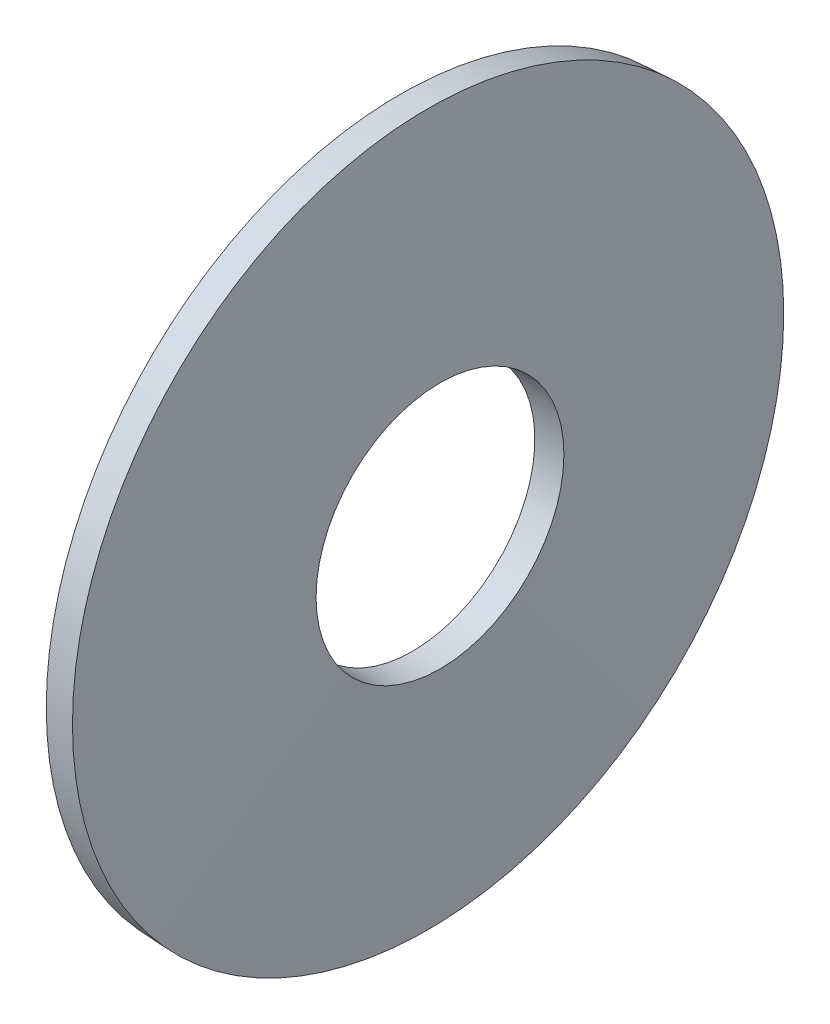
ISO-10303-21;
HEADER;
FILE_DESCRIPTION(('STEP AP214'),'2;1');
FILE_NAME('part.step','',(''),(''),'','','');
FILE_SCHEMA(('AUTOMOTIVE_DESIGN { 1 0 10303 214 1 1 1 1 }'));
ENDSEC;
DATA;
#1=APPLICATION_CONTEXT('core data for automotive mechanical design processes');
#2=APPLICATION_PROTOCOL_DEFINITION('international standard','automotive_design',2000,#1);
#3=PRODUCT_CONTEXT('',#1,'mechanical');
#4=PRODUCT('Part','Part','',(#3));
#5=PRODUCT_RELATED_PRODUCT_CATEGORY('part','',(#4));
#6=PRODUCT_DEFINITION_FORMATION('','',#4);
#7=PRODUCT_DEFINITION_CONTEXT('part definition',#1,'design');
#8=PRODUCT_DEFINITION('design','',#6,#7);
#9=PRODUCT_DEFINITION_SHAPE('','',#8);
#10=(LENGTH_UNIT() NAMED_UNIT(*) SI_UNIT(.MILLI.,.METRE.));
#11=(NAMED_UNIT(*) PLANE_ANGLE_UNIT() SI_UNIT($,.RADIAN.));
#12=(NAMED_UNIT(*) SI_UNIT($,.STERADIAN.) SOLID_ANGLE_UNIT());
#13=UNCERTAINTY_MEASURE_WITH_UNIT(LENGTH_MEASURE(1.E-05),#10,'distance_accuracy_value','');
#14=(GEOMETRIC_REPRESENTATION_CONTEXT(3) GLOBAL_UNCERTAINTY_ASSIGNED_CONTEXT((#13)) GLOBAL_UNIT_ASSIGNED_CONTEXT((#10,
#11,#12)) REPRESENTATION_CONTEXT('',''));
#15=CARTESIAN_POINT('',(0.,0.,0.));
#16=DIRECTION('',(0.,0.,1.));
#17=DIRECTION('',(1.,0.,0.));
#18=AXIS2_PLACEMENT_3D('',#15,#16,#17);
#19=CARTESIAN_POINT('',(0.69908017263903,0.,0.));
#20=DIRECTION('',(1.,0.,0.));
#21=DIRECTION('',(0.,0.,-1.));
#22=AXIS2_PLACEMENT_3D('',#19,#20,#21);
#23=CONICAL_SURFACE('',#22,9.,0.0512704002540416);
#24=CARTESIAN_POINT('',(0.,0.,0.));
#25=DIRECTION('',(-1.,0.,0.));
#26=DIRECTION('',(0.,0.,1.));
#27=AXIS2_PLACEMENT_3D('',#24,#25,#26);
#28=CIRCLE('',#27,8.96412644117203);
#29=CARTESIAN_POINT('',(0.,0.,8.96412644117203));
#30=VERTEX_POINT('',#29);
#31=EDGE_CURVE('E10',#30,#30,#28,.T.);
#32=ORIENTED_EDGE('',*,*,#31,.F.);
#33=EDGE_LOOP('',(#32));
#34=FACE_BOUND('',#33,.T.);
#35=CARTESIAN_POINT('',(0.69908017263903,0.,0.));
#36=DIRECTION('',(-1.,0.,0.));
#37=DIRECTION('',(0.,0.,1.));
#38=AXIS2_PLACEMENT_3D('',#35,#36,#37);
#39=CIRCLE('',#38,9.);
#40=CARTESIAN_POINT('',(0.69908017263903,0.,9.));
#41=VERTEX_POINT('',#40);
#42=EDGE_CURVE('E43',#41,#41,#39,.T.);
#43=ORIENTED_EDGE('',*,*,#42,.T.);
#44=EDGE_LOOP('',(#43));
#45=FACE_BOUND('',#44,.T.);
#46=ADVANCED_FACE('F29',(#34,#45),#23,.T.);
#47=CARTESIAN_POINT('',(0.,0.,0.));
#48=DIRECTION('',(-1.,0.,0.));
#49=DIRECTION('',(0.,0.,1.));
#50=AXIS2_PLACEMENT_3D('',#47,#48,#49);
#51=CONICAL_SURFACE('',#50,8.96412644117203,1.51952592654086);
#52=CARTESIAN_POINT('',(0.300919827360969,0.,0.));
#53=DIRECTION('',(-1.,0.,0.));
#54=DIRECTION('',(0.,0.,1.));
#55=AXIS2_PLACEMENT_3D('',#52,#53,#54);
#56=CIRCLE('',#55,3.1);
#57=CARTESIAN_POINT('',(0.300919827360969,0.,3.1));
#58=VERTEX_POINT('',#57);
#59=EDGE_CURVE('E35',#58,#58,#56,.T.);
#60=ORIENTED_EDGE('',*,*,#59,.F.);
#61=EDGE_LOOP('',(#60));
#62=FACE_BOUND('',#61,.T.);
#63=ORIENTED_EDGE('',*,*,#31,.T.);
#64=EDGE_LOOP('',(#63));
#65=FACE_BOUND('',#64,.T.);
#66=ADVANCED_FACE('F58',(#62,#65),#51,.F.);
#67=CARTESIAN_POINT('',(0.300919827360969,0.,0.));
#68=DIRECTION('',(1.,0.,0.));
#69=DIRECTION('',(0.,0.,-1.));
#70=AXIS2_PLACEMENT_3D('',#67,#68,#69);
#71=CONICAL_SURFACE('',#70,3.1,0.051270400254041);
#72=CARTESIAN_POINT('',(1.,0.,0.));
#73=DIRECTION('',(-1.,0.,0.));
#74=DIRECTION('',(0.,0.,1.));
#75=AXIS2_PLACEMENT_3D('',#72,#73,#74);
#76=CIRCLE('',#75,3.13587355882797);
#77=CARTESIAN_POINT('',(1.,0.,3.13587355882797));
#78=VERTEX_POINT('',#77);
#79=EDGE_CURVE('E39',#78,#78,#76,.T.);
#80=ORIENTED_EDGE('',*,*,#79,.F.);
#81=EDGE_LOOP('',(#80));
#82=FACE_BOUND('',#81,.T.);
#83=ORIENTED_EDGE('',*,*,#59,.T.);
#84=EDGE_LOOP('',(#83));
#85=FACE_BOUND('',#84,.T.);
#86=ADVANCED_FACE('F53',(#82,#85),#71,.F.);
#87=CARTESIAN_POINT('',(1.,0.,0.));
#88=DIRECTION('',(-1.,0.,0.));
#89=DIRECTION('',(0.,0.,1.));
#90=AXIS2_PLACEMENT_3D('',#87,#88,#89);
#91=CONICAL_SURFACE('',#90,3.13587355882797,1.51952592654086);
#92=ORIENTED_EDGE('',*,*,#42,.F.);
#93=EDGE_LOOP('',(#92));
#94=FACE_BOUND('',#93,.T.);
#95=ORIENTED_EDGE('',*,*,#79,.T.);
#96=EDGE_LOOP('',(#95));
#97=FACE_BOUND('',#96,.T.);
#98=ADVANCED_FACE('F50',(#94,#97),#91,.T.);
#99=CLOSED_SHELL('',(#46,#66,#86,#98));
#100=MANIFOLD_SOLID_BREP('B2',#99);
#101=ADVANCED_BREP_SHAPE_REPRESENTATION('',(#18,#100),#14);
#102=SHAPE_DEFINITION_REPRESENTATION(#9,#101);
ENDSEC;
END-ISO-10303-21;
